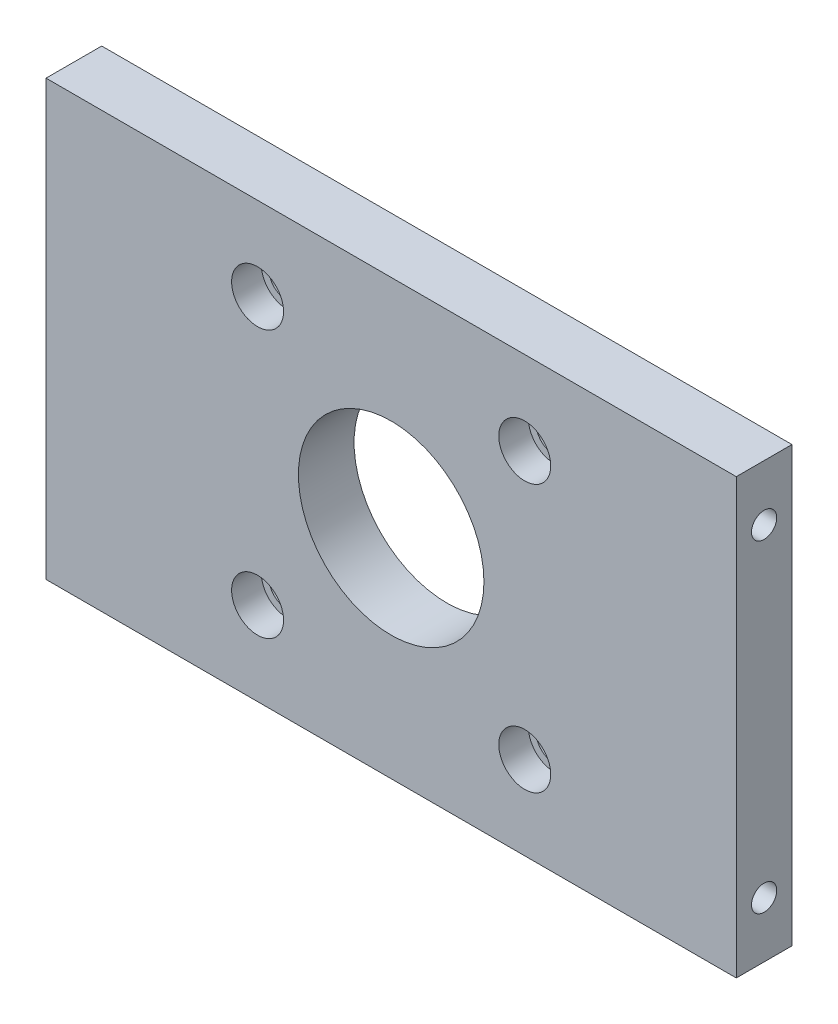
ISO-10303-21;
HEADER;
FILE_DESCRIPTION(('STEP AP214'),'2;1');
FILE_NAME('part.step','',(''),(''),'','','');
FILE_SCHEMA(('AUTOMOTIVE_DESIGN { 1 0 10303 214 1 1 1 1 }'));
ENDSEC;
DATA;
#1=APPLICATION_CONTEXT('core data for automotive mechanical design processes');
#2=APPLICATION_PROTOCOL_DEFINITION('international standard','automotive_design',2000,#1);
#3=PRODUCT_CONTEXT('',#1,'mechanical');
#4=PRODUCT('Part','Part','',(#3));
#5=PRODUCT_RELATED_PRODUCT_CATEGORY('part','',(#4));
#6=PRODUCT_DEFINITION_FORMATION('','',#4);
#7=PRODUCT_DEFINITION_CONTEXT('part definition',#1,'design');
#8=PRODUCT_DEFINITION('design','',#6,#7);
#9=PRODUCT_DEFINITION_SHAPE('','',#8);
#10=(LENGTH_UNIT() NAMED_UNIT(*) SI_UNIT(.MILLI.,.METRE.));
#11=(NAMED_UNIT(*) PLANE_ANGLE_UNIT() SI_UNIT($,.RADIAN.));
#12=(NAMED_UNIT(*) SI_UNIT($,.STERADIAN.) SOLID_ANGLE_UNIT());
#13=UNCERTAINTY_MEASURE_WITH_UNIT(LENGTH_MEASURE(1.E-05),#10,'distance_accuracy_value','');
#14=(GEOMETRIC_REPRESENTATION_CONTEXT(3) GLOBAL_UNCERTAINTY_ASSIGNED_CONTEXT((#13)) GLOBAL_UNIT_ASSIGNED_CONTEXT((#10,
#11,#12)) REPRESENTATION_CONTEXT('',''));
#15=CARTESIAN_POINT('',(0.,0.,0.));
#16=DIRECTION('',(0.,0.,1.));
#17=DIRECTION('',(1.,0.,0.));
#18=AXIS2_PLACEMENT_3D('',#15,#16,#17);
#19=CARTESIAN_POINT('',(-69.9731301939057,63.6934903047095,15.));
#20=DIRECTION('',(1.,0.,0.));
#21=DIRECTION('',(0.,1.,0.));
#22=AXIS2_PLACEMENT_3D('',#19,#20,#21);
#23=PLANE('',#22);
#24=CARTESIAN_POINT('',(-69.9731301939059,48.6934903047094,7.50000000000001));
#25=DIRECTION('',(-1.,0.,0.));
#26=DIRECTION('',(0.,0.,1.));
#27=AXIS2_PLACEMENT_3D('',#24,#25,#26);
#28=CIRCLE('',#27,3.4);
#29=CARTESIAN_POINT('',(-69.9731301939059,48.6934903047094,10.9));
#30=VERTEX_POINT('',#29);
#31=EDGE_CURVE('E113',#30,#30,#28,.T.);
#32=ORIENTED_EDGE('',*,*,#31,.F.);
#33=EDGE_LOOP('',(#32));
#34=FACE_BOUND('',#33,.T.);
#35=CARTESIAN_POINT('',(-69.9731301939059,-38.3065096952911,7.50000000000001));
#36=DIRECTION('',(-1.,0.,0.));
#37=DIRECTION('',(0.,0.,1.));
#38=AXIS2_PLACEMENT_3D('',#35,#36,#37);
#39=CIRCLE('',#38,3.4);
#40=CARTESIAN_POINT('',(-69.9731301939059,-38.3065096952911,10.9));
#41=VERTEX_POINT('',#40);
#42=EDGE_CURVE('E119',#41,#41,#39,.T.);
#43=ORIENTED_EDGE('',*,*,#42,.F.);
#44=EDGE_LOOP('',(#43));
#45=FACE_BOUND('',#44,.T.);
#46=DIRECTION('',(0.,-1.,0.));
#47=VECTOR('',#46,1.);
#48=CARTESIAN_POINT('',(-69.9731301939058,63.6934903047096,-2.22044604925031E-13));
#49=LINE('',#48,#47);
#50=CARTESIAN_POINT('',(-69.9731301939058,63.6934903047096,-2.22044604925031E-13));
#51=VERTEX_POINT('',#50);
#52=CARTESIAN_POINT('',(-69.9731301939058,-53.3065096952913,0.));
#53=VERTEX_POINT('',#52);
#54=EDGE_CURVE('E167',#51,#53,#49,.T.);
#55=ORIENTED_EDGE('',*,*,#54,.T.);
#56=DIRECTION('',(0.,0.,-1.));
#57=VECTOR('',#56,1.);
#58=CARTESIAN_POINT('',(-69.9731301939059,-53.3065096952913,15.));
#59=LINE('',#58,#57);
#60=CARTESIAN_POINT('',(-69.9731301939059,-53.3065096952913,15.));
#61=VERTEX_POINT('',#60);
#62=EDGE_CURVE('E13',#61,#53,#59,.T.);
#63=ORIENTED_EDGE('',*,*,#62,.F.);
#64=DIRECTION('',(0.,-1.,0.));
#65=VECTOR('',#64,1.);
#66=CARTESIAN_POINT('',(-69.9731301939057,63.6934903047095,15.));
#67=LINE('',#66,#65);
#68=CARTESIAN_POINT('',(-69.9731301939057,63.6934903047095,15.));
#69=VERTEX_POINT('',#68);
#70=EDGE_CURVE('E176',#69,#61,#67,.T.);
#71=ORIENTED_EDGE('',*,*,#70,.F.);
#72=DIRECTION('',(0.,0.,-1.));
#73=VECTOR('',#72,1.);
#74=CARTESIAN_POINT('',(-69.9731301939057,63.6934903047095,15.));
#75=LINE('',#74,#73);
#76=EDGE_CURVE('E182',#69,#51,#75,.T.);
#77=ORIENTED_EDGE('',*,*,#76,.T.);
#78=EDGE_LOOP('',(#55,#63,#71,#77));
#79=FACE_BOUND('',#78,.T.);
#80=ADVANCED_FACE('F38',(#34,#45,#79),#23,.F.);
#81=CARTESIAN_POINT('',(-69.9731301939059,-53.3065096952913,15.));
#82=DIRECTION('',(0.,1.,0.));
#83=DIRECTION('',(0.,0.,1.));
#84=AXIS2_PLACEMENT_3D('',#81,#82,#83);
#85=PLANE('',#84);
#86=DIRECTION('',(1.,0.,0.));
#87=VECTOR('',#86,1.);
#88=CARTESIAN_POINT('',(-69.9731301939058,-53.3065096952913,0.));
#89=LINE('',#88,#87);
#90=CARTESIAN_POINT('',(116.026869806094,-53.3065096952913,0.));
#91=VERTEX_POINT('',#90);
#92=EDGE_CURVE('E170',#53,#91,#89,.T.);
#93=ORIENTED_EDGE('',*,*,#92,.T.);
#94=DIRECTION('',(0.,0.,-1.));
#95=VECTOR('',#94,1.);
#96=CARTESIAN_POINT('',(116.026869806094,-53.3065096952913,15.));
#97=LINE('',#96,#95);
#98=CARTESIAN_POINT('',(116.026869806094,-53.3065096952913,15.));
#99=VERTEX_POINT('',#98);
#100=EDGE_CURVE('E46',#99,#91,#97,.T.);
#101=ORIENTED_EDGE('',*,*,#100,.F.);
#102=DIRECTION('',(1.,0.,0.));
#103=VECTOR('',#102,1.);
#104=CARTESIAN_POINT('',(-69.9731301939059,-53.3065096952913,15.));
#105=LINE('',#104,#103);
#106=EDGE_CURVE('E178',#61,#99,#105,.T.);
#107=ORIENTED_EDGE('',*,*,#106,.F.);
#108=ORIENTED_EDGE('',*,*,#62,.T.);
#109=EDGE_LOOP('',(#93,#101,#107,#108));
#110=FACE_BOUND('',#109,.T.);
#111=ADVANCED_FACE('F218',(#110),#85,.F.);
#112=CARTESIAN_POINT('',(116.026869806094,63.6934903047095,15.));
#113=DIRECTION('',(-1.,0.,0.));
#114=DIRECTION('',(0.,-1.,0.));
#115=AXIS2_PLACEMENT_3D('',#112,#113,#114);
#116=PLANE('',#115);
#117=CARTESIAN_POINT('',(116.026869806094,48.6934903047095,7.50000000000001));
#118=DIRECTION('',(1.,0.,0.));
#119=DIRECTION('',(0.,0.,-1.));
#120=AXIS2_PLACEMENT_3D('',#117,#118,#119);
#121=CIRCLE('',#120,3.39999999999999);
#122=CARTESIAN_POINT('',(116.026869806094,48.6934903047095,4.1));
#123=VERTEX_POINT('',#122);
#124=EDGE_CURVE('E99',#123,#123,#121,.T.);
#125=ORIENTED_EDGE('',*,*,#124,.F.);
#126=EDGE_LOOP('',(#125));
#127=FACE_BOUND('',#126,.T.);
#128=CARTESIAN_POINT('',(116.026869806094,-38.3065096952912,7.50000000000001));
#129=DIRECTION('',(1.,0.,0.));
#130=DIRECTION('',(0.,0.,-1.));
#131=AXIS2_PLACEMENT_3D('',#128,#129,#130);
#132=CIRCLE('',#131,3.39999999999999);
#133=CARTESIAN_POINT('',(116.026869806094,-38.3065096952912,4.1));
#134=VERTEX_POINT('',#133);
#135=EDGE_CURVE('E107',#134,#134,#132,.T.);
#136=ORIENTED_EDGE('',*,*,#135,.F.);
#137=EDGE_LOOP('',(#136));
#138=FACE_BOUND('',#137,.T.);
#139=DIRECTION('',(0.,1.,0.));
#140=VECTOR('',#139,1.);
#141=CARTESIAN_POINT('',(116.026869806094,63.6934903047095,0.));
#142=LINE('',#141,#140);
#143=CARTESIAN_POINT('',(116.026869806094,63.6934903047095,0.));
#144=VERTEX_POINT('',#143);
#145=EDGE_CURVE('E172',#91,#144,#142,.T.);
#146=ORIENTED_EDGE('',*,*,#145,.T.);
#147=DIRECTION('',(0.,0.,-1.));
#148=VECTOR('',#147,1.);
#149=CARTESIAN_POINT('',(116.026869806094,63.6934903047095,15.));
#150=LINE('',#149,#148);
#151=CARTESIAN_POINT('',(116.026869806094,63.6934903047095,15.));
#152=VERTEX_POINT('',#151);
#153=EDGE_CURVE('E185',#152,#144,#150,.T.);
#154=ORIENTED_EDGE('',*,*,#153,.F.);
#155=DIRECTION('',(0.,1.,0.));
#156=VECTOR('',#155,1.);
#157=CARTESIAN_POINT('',(116.026869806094,63.6934903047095,15.));
#158=LINE('',#157,#156);
#159=EDGE_CURVE('E59',#99,#152,#158,.T.);
#160=ORIENTED_EDGE('',*,*,#159,.F.);
#161=ORIENTED_EDGE('',*,*,#100,.T.);
#162=EDGE_LOOP('',(#146,#154,#160,#161));
#163=FACE_BOUND('',#162,.T.);
#164=ADVANCED_FACE('F224',(#127,#138,#163),#116,.F.);
#165=CARTESIAN_POINT('',(-69.9731301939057,63.6934903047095,15.));
#166=DIRECTION('',(0.,-1.,0.));
#167=DIRECTION('',(0.,0.,-1.));
#168=AXIS2_PLACEMENT_3D('',#165,#166,#167);
#169=PLANE('',#168);
#170=DIRECTION('',(-1.,0.,0.));
#171=VECTOR('',#170,1.);
#172=CARTESIAN_POINT('',(-69.9731301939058,63.6934903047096,-2.22044604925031E-13));
#173=LINE('',#172,#171);
#174=EDGE_CURVE('E174',#144,#51,#173,.T.);
#175=ORIENTED_EDGE('',*,*,#174,.T.);
#176=ORIENTED_EDGE('',*,*,#76,.F.);
#177=DIRECTION('',(-1.,0.,0.));
#178=VECTOR('',#177,1.);
#179=CARTESIAN_POINT('',(-69.9731301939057,63.6934903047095,15.));
#180=LINE('',#179,#178);
#181=EDGE_CURVE('E54',#152,#69,#180,.T.);
#182=ORIENTED_EDGE('',*,*,#181,.F.);
#183=ORIENTED_EDGE('',*,*,#153,.T.);
#184=EDGE_LOOP('',(#175,#176,#182,#183));
#185=FACE_BOUND('',#184,.T.);
#186=ADVANCED_FACE('F239',(#185),#169,.F.);
#187=CARTESIAN_POINT('',(-69.9731301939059,-53.3065096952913,15.));
#188=DIRECTION('',(0.,0.,1.));
#189=DIRECTION('',(1.,0.,0.));
#190=AXIS2_PLACEMENT_3D('',#187,#188,#189);
#191=PLANE('',#190);
#192=CARTESIAN_POINT('',(-12.9731301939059,41.1934903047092,15.));
#193=DIRECTION('',(0.,0.,1.));
#194=DIRECTION('',(1.,0.,0.));
#195=AXIS2_PLACEMENT_3D('',#192,#193,#194);
#196=CIRCLE('',#195,7.);
#197=CARTESIAN_POINT('',(-5.97313019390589,41.1934903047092,15.));
#198=VERTEX_POINT('',#197);
#199=EDGE_CURVE('E128',#198,#198,#196,.T.);
#200=ORIENTED_EDGE('',*,*,#199,.F.);
#201=EDGE_LOOP('',(#200));
#202=FACE_BOUND('',#201,.T.);
#203=CARTESIAN_POINT('',(-12.9731301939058,-30.8065096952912,15.));
#204=DIRECTION('',(0.,0.,1.));
#205=DIRECTION('',(1.,0.,0.));
#206=AXIS2_PLACEMENT_3D('',#203,#204,#205);
#207=CIRCLE('',#206,7.);
#208=CARTESIAN_POINT('',(-5.97313019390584,-30.8065096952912,15.));
#209=VERTEX_POINT('',#208);
#210=EDGE_CURVE('E137',#209,#209,#207,.T.);
#211=ORIENTED_EDGE('',*,*,#210,.F.);
#212=EDGE_LOOP('',(#211));
#213=FACE_BOUND('',#212,.T.);
#214=CARTESIAN_POINT('',(59.0268698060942,-30.8065096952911,15.));
#215=DIRECTION('',(0.,0.,1.));
#216=DIRECTION('',(1.,0.,0.));
#217=AXIS2_PLACEMENT_3D('',#214,#215,#216);
#218=CIRCLE('',#217,7.);
#219=CARTESIAN_POINT('',(66.0268698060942,-30.8065096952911,15.));
#220=VERTEX_POINT('',#219);
#221=EDGE_CURVE('E147',#220,#220,#218,.T.);
#222=ORIENTED_EDGE('',*,*,#221,.F.);
#223=EDGE_LOOP('',(#222));
#224=FACE_BOUND('',#223,.T.);
#225=CARTESIAN_POINT('',(59.0268698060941,41.1934903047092,15.));
#226=DIRECTION('',(0.,0.,1.));
#227=DIRECTION('',(1.,0.,0.));
#228=AXIS2_PLACEMENT_3D('',#225,#226,#227);
#229=CIRCLE('',#228,7.);
#230=CARTESIAN_POINT('',(66.0268698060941,41.1934903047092,15.));
#231=VERTEX_POINT('',#230);
#232=EDGE_CURVE('E157',#231,#231,#229,.T.);
#233=ORIENTED_EDGE('',*,*,#232,.F.);
#234=EDGE_LOOP('',(#233));
#235=FACE_BOUND('',#234,.T.);
#236=CARTESIAN_POINT('',(23.0268698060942,5.19349030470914,15.));
#237=DIRECTION('',(0.,0.,1.));
#238=DIRECTION('',(1.,0.,0.));
#239=AXIS2_PLACEMENT_3D('',#236,#237,#238);
#240=CIRCLE('',#239,25.);
#241=CARTESIAN_POINT('',(48.0268698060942,5.19349030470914,15.));
#242=VERTEX_POINT('',#241);
#243=EDGE_CURVE('E161',#242,#242,#240,.T.);
#244=ORIENTED_EDGE('',*,*,#243,.F.);
#245=EDGE_LOOP('',(#244));
#246=FACE_BOUND('',#245,.T.);
#247=ORIENTED_EDGE('',*,*,#70,.T.);
#248=ORIENTED_EDGE('',*,*,#106,.T.);
#249=ORIENTED_EDGE('',*,*,#159,.T.);
#250=ORIENTED_EDGE('',*,*,#181,.T.);
#251=EDGE_LOOP('',(#247,#248,#249,#250));
#252=FACE_BOUND('',#251,.T.);
#253=ADVANCED_FACE('F237',(#202,#213,#224,#235,#246,#252),#191,.T.);
#254=CARTESIAN_POINT('',(-69.9731301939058,-53.3065096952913,0.));
#255=DIRECTION('',(0.,0.,1.));
#256=DIRECTION('',(1.,0.,0.));
#257=AXIS2_PLACEMENT_3D('',#254,#255,#256);
#258=PLANE('',#257);
#259=CARTESIAN_POINT('',(-12.9731301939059,41.1934903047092,0.));
#260=DIRECTION('',(0.,0.,1.));
#261=DIRECTION('',(1.,0.,0.));
#262=AXIS2_PLACEMENT_3D('',#259,#260,#261);
#263=CIRCLE('',#262,4.99999999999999);
#264=CARTESIAN_POINT('',(-7.9731301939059,41.1934903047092,0.));
#265=VERTEX_POINT('',#264);
#266=EDGE_CURVE('E41',#265,#265,#263,.T.);
#267=ORIENTED_EDGE('',*,*,#266,.T.);
#268=EDGE_LOOP('',(#267));
#269=FACE_BOUND('',#268,.T.);
#270=CARTESIAN_POINT('',(-12.9731301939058,-30.8065096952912,0.));
#271=DIRECTION('',(0.,0.,1.));
#272=DIRECTION('',(1.,0.,0.));
#273=AXIS2_PLACEMENT_3D('',#270,#271,#272);
#274=CIRCLE('',#273,4.99999999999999);
#275=CARTESIAN_POINT('',(-7.97313019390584,-30.8065096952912,0.));
#276=VERTEX_POINT('',#275);
#277=EDGE_CURVE('E140',#276,#276,#274,.T.);
#278=ORIENTED_EDGE('',*,*,#277,.T.);
#279=EDGE_LOOP('',(#278));
#280=FACE_BOUND('',#279,.T.);
#281=CARTESIAN_POINT('',(59.0268698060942,-30.8065096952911,0.));
#282=DIRECTION('',(0.,0.,1.));
#283=DIRECTION('',(1.,0.,0.));
#284=AXIS2_PLACEMENT_3D('',#281,#282,#283);
#285=CIRCLE('',#284,4.99999999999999);
#286=CARTESIAN_POINT('',(64.0268698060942,-30.8065096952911,0.));
#287=VERTEX_POINT('',#286);
#288=EDGE_CURVE('E150',#287,#287,#285,.T.);
#289=ORIENTED_EDGE('',*,*,#288,.T.);
#290=EDGE_LOOP('',(#289));
#291=FACE_BOUND('',#290,.T.);
#292=CARTESIAN_POINT('',(59.0268698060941,41.1934903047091,0.));
#293=DIRECTION('',(0.,0.,1.));
#294=DIRECTION('',(1.,0.,0.));
#295=AXIS2_PLACEMENT_3D('',#292,#293,#294);
#296=CIRCLE('',#295,4.99999999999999);
#297=CARTESIAN_POINT('',(64.0268698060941,41.1934903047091,0.));
#298=VERTEX_POINT('',#297);
#299=EDGE_CURVE('E160',#298,#298,#296,.T.);
#300=ORIENTED_EDGE('',*,*,#299,.T.);
#301=EDGE_LOOP('',(#300));
#302=FACE_BOUND('',#301,.T.);
#303=CARTESIAN_POINT('',(23.0268698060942,5.19349030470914,0.));
#304=DIRECTION('',(0.,0.,1.));
#305=DIRECTION('',(1.,0.,0.));
#306=AXIS2_PLACEMENT_3D('',#303,#304,#305);
#307=CIRCLE('',#306,25.);
#308=CARTESIAN_POINT('',(48.0268698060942,5.19349030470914,0.));
#309=VERTEX_POINT('',#308);
#310=EDGE_CURVE('E164',#309,#309,#307,.T.);
#311=ORIENTED_EDGE('',*,*,#310,.T.);
#312=EDGE_LOOP('',(#311));
#313=FACE_BOUND('',#312,.T.);
#314=ORIENTED_EDGE('',*,*,#54,.F.);
#315=ORIENTED_EDGE('',*,*,#174,.F.);
#316=ORIENTED_EDGE('',*,*,#145,.F.);
#317=ORIENTED_EDGE('',*,*,#92,.F.);
#318=EDGE_LOOP('',(#314,#315,#316,#317));
#319=FACE_BOUND('',#318,.T.);
#320=ADVANCED_FACE('F196',(#269,#280,#291,#302,#313,#319),#258,.F.);
#321=CARTESIAN_POINT('',(23.0268698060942,5.19349030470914,0.));
#322=DIRECTION('',(0.,0.,1.));
#323=DIRECTION('',(1.,0.,0.));
#324=AXIS2_PLACEMENT_3D('',#321,#322,#323);
#325=CYLINDRICAL_SURFACE('',#324,25.);
#326=ORIENTED_EDGE('',*,*,#310,.F.);
#327=EDGE_LOOP('',(#326));
#328=FACE_BOUND('',#327,.T.);
#329=ORIENTED_EDGE('',*,*,#243,.T.);
#330=EDGE_LOOP('',(#329));
#331=FACE_BOUND('',#330,.T.);
#332=ADVANCED_FACE('F245',(#328,#331),#325,.F.);
#333=CARTESIAN_POINT('',(59.0268698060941,41.1934903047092,15.));
#334=DIRECTION('',(0.,0.,1.));
#335=DIRECTION('',(1.,0.,0.));
#336=AXIS2_PLACEMENT_3D('',#333,#334,#335);
#337=CYLINDRICAL_SURFACE('',#336,4.99999999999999);
#338=CARTESIAN_POINT('',(59.0268698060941,41.1934903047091,7.00000000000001));
#339=DIRECTION('',(0.,0.,1.));
#340=DIRECTION('',(1.,0.,0.));
#341=AXIS2_PLACEMENT_3D('',#338,#339,#340);
#342=CIRCLE('',#341,5.);
#343=CARTESIAN_POINT('',(64.0268698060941,41.1934903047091,7.00000000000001));
#344=VERTEX_POINT('',#343);
#345=EDGE_CURVE('E151',#344,#344,#342,.T.);
#346=ORIENTED_EDGE('',*,*,#345,.T.);
#347=EDGE_LOOP('',(#346));
#348=FACE_BOUND('',#347,.T.);
#349=ORIENTED_EDGE('',*,*,#299,.F.);
#350=EDGE_LOOP('',(#349));
#351=FACE_BOUND('',#350,.T.);
#352=ADVANCED_FACE('F353',(#348,#351),#337,.F.);
#353=CARTESIAN_POINT('',(59.0268698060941,41.1934903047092,15.));
#354=DIRECTION('',(0.,0.,1.));
#355=DIRECTION('',(1.,0.,0.));
#356=AXIS2_PLACEMENT_3D('',#353,#354,#355);
#357=CYLINDRICAL_SURFACE('',#356,7.);
#358=CARTESIAN_POINT('',(59.0268698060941,41.1934903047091,7.00000000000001));
#359=DIRECTION('',(0.,0.,1.));
#360=DIRECTION('',(1.,0.,0.));
#361=AXIS2_PLACEMENT_3D('',#358,#359,#360);
#362=CIRCLE('',#361,7.);
#363=CARTESIAN_POINT('',(66.0268698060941,41.1934903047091,7.00000000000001));
#364=VERTEX_POINT('',#363);
#365=EDGE_CURVE('E154',#364,#364,#362,.T.);
#366=ORIENTED_EDGE('',*,*,#365,.F.);
#367=EDGE_LOOP('',(#366));
#368=FACE_BOUND('',#367,.T.);
#369=ORIENTED_EDGE('',*,*,#232,.T.);
#370=EDGE_LOOP('',(#369));
#371=FACE_BOUND('',#370,.T.);
#372=ADVANCED_FACE('F356',(#368,#371),#357,.F.);
#373=CARTESIAN_POINT('',(64.0268698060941,41.1934903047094,7.00000000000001));
#374=DIRECTION('',(0.,0.,-1.));
#375=DIRECTION('',(-1.,0.,0.));
#376=AXIS2_PLACEMENT_3D('',#373,#374,#375);
#377=PLANE('',#376);
#378=ORIENTED_EDGE('',*,*,#345,.F.);
#379=EDGE_LOOP('',(#378));
#380=FACE_BOUND('',#379,.T.);
#381=ORIENTED_EDGE('',*,*,#365,.T.);
#382=EDGE_LOOP('',(#381));
#383=FACE_BOUND('',#382,.T.);
#384=ADVANCED_FACE('F347',(#380,#383),#377,.F.);
#385=CARTESIAN_POINT('',(59.0268698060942,-30.8065096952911,15.));
#386=DIRECTION('',(0.,0.,1.));
#387=DIRECTION('',(1.,0.,0.));
#388=AXIS2_PLACEMENT_3D('',#385,#386,#387);
#389=CYLINDRICAL_SURFACE('',#388,4.99999999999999);
#390=CARTESIAN_POINT('',(59.0268698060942,-30.8065096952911,7.00000000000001));
#391=DIRECTION('',(0.,0.,1.));
#392=DIRECTION('',(1.,0.,0.));
#393=AXIS2_PLACEMENT_3D('',#390,#391,#392);
#394=CIRCLE('',#393,5.);
#395=CARTESIAN_POINT('',(64.0268698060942,-30.8065096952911,7.00000000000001));
#396=VERTEX_POINT('',#395);
#397=EDGE_CURVE('E141',#396,#396,#394,.T.);
#398=ORIENTED_EDGE('',*,*,#397,.T.);
#399=EDGE_LOOP('',(#398));
#400=FACE_BOUND('',#399,.T.);
#401=ORIENTED_EDGE('',*,*,#288,.F.);
#402=EDGE_LOOP('',(#401));
#403=FACE_BOUND('',#402,.T.);
#404=ADVANCED_FACE('F345',(#400,#403),#389,.F.);
#405=CARTESIAN_POINT('',(59.0268698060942,-30.8065096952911,15.));
#406=DIRECTION('',(0.,0.,1.));
#407=DIRECTION('',(1.,0.,0.));
#408=AXIS2_PLACEMENT_3D('',#405,#406,#407);
#409=CYLINDRICAL_SURFACE('',#408,7.);
#410=CARTESIAN_POINT('',(59.0268698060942,-30.8065096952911,7.00000000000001));
#411=DIRECTION('',(0.,0.,1.));
#412=DIRECTION('',(1.,0.,0.));
#413=AXIS2_PLACEMENT_3D('',#410,#411,#412);
#414=CIRCLE('',#413,7.);
#415=CARTESIAN_POINT('',(66.0268698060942,-30.8065096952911,7.00000000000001));
#416=VERTEX_POINT('',#415);
#417=EDGE_CURVE('E144',#416,#416,#414,.T.);
#418=ORIENTED_EDGE('',*,*,#417,.F.);
#419=EDGE_LOOP('',(#418));
#420=FACE_BOUND('',#419,.T.);
#421=ORIENTED_EDGE('',*,*,#221,.T.);
#422=EDGE_LOOP('',(#421));
#423=FACE_BOUND('',#422,.T.);
#424=ADVANCED_FACE('F212',(#420,#423),#409,.F.);
#425=CARTESIAN_POINT('',(64.0268698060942,-30.8065096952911,7.00000000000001));
#426=DIRECTION('',(0.,0.,-1.));
#427=DIRECTION('',(-1.,0.,0.));
#428=AXIS2_PLACEMENT_3D('',#425,#426,#427);
#429=PLANE('',#428);
#430=ORIENTED_EDGE('',*,*,#397,.F.);
#431=EDGE_LOOP('',(#430));
#432=FACE_BOUND('',#431,.T.);
#433=ORIENTED_EDGE('',*,*,#417,.T.);
#434=EDGE_LOOP('',(#433));
#435=FACE_BOUND('',#434,.T.);
#436=ADVANCED_FACE('F202',(#432,#435),#429,.F.);
#437=CARTESIAN_POINT('',(-12.9731301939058,-30.8065096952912,15.));
#438=DIRECTION('',(0.,0.,1.));
#439=DIRECTION('',(1.,0.,0.));
#440=AXIS2_PLACEMENT_3D('',#437,#438,#439);
#441=CYLINDRICAL_SURFACE('',#440,4.99999999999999);
#442=CARTESIAN_POINT('',(-12.9731301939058,-30.8065096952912,7.00000000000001));
#443=DIRECTION('',(0.,0.,1.));
#444=DIRECTION('',(1.,0.,0.));
#445=AXIS2_PLACEMENT_3D('',#442,#443,#444);
#446=CIRCLE('',#445,4.99999999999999);
#447=CARTESIAN_POINT('',(-7.97313019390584,-30.8065096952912,7.00000000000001));
#448=VERTEX_POINT('',#447);
#449=EDGE_CURVE('E131',#448,#448,#446,.T.);
#450=ORIENTED_EDGE('',*,*,#449,.T.);
#451=EDGE_LOOP('',(#450));
#452=FACE_BOUND('',#451,.T.);
#453=ORIENTED_EDGE('',*,*,#277,.F.);
#454=EDGE_LOOP('',(#453));
#455=FACE_BOUND('',#454,.T.);
#456=ADVANCED_FACE('F199',(#452,#455),#441,.F.);
#457=CARTESIAN_POINT('',(-12.9731301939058,-30.8065096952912,15.));
#458=DIRECTION('',(0.,0.,1.));
#459=DIRECTION('',(1.,0.,0.));
#460=AXIS2_PLACEMENT_3D('',#457,#458,#459);
#461=CYLINDRICAL_SURFACE('',#460,7.);
#462=CARTESIAN_POINT('',(-12.9731301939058,-30.8065096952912,7.00000000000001));
#463=DIRECTION('',(0.,0.,1.));
#464=DIRECTION('',(1.,0.,0.));
#465=AXIS2_PLACEMENT_3D('',#462,#463,#464);
#466=CIRCLE('',#465,7.);
#467=CARTESIAN_POINT('',(-5.97313019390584,-30.8065096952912,7.00000000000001));
#468=VERTEX_POINT('',#467);
#469=EDGE_CURVE('E134',#468,#468,#466,.T.);
#470=ORIENTED_EDGE('',*,*,#469,.F.);
#471=EDGE_LOOP('',(#470));
#472=FACE_BOUND('',#471,.T.);
#473=ORIENTED_EDGE('',*,*,#210,.T.);
#474=EDGE_LOOP('',(#473));
#475=FACE_BOUND('',#474,.T.);
#476=ADVANCED_FACE('F201',(#472,#475),#461,.F.);
#477=CARTESIAN_POINT('',(-7.97313019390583,-30.806509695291,7.00000000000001));
#478=DIRECTION('',(0.,0.,-1.));
#479=DIRECTION('',(-1.,0.,0.));
#480=AXIS2_PLACEMENT_3D('',#477,#478,#479);
#481=PLANE('',#480);
#482=ORIENTED_EDGE('',*,*,#449,.F.);
#483=EDGE_LOOP('',(#482));
#484=FACE_BOUND('',#483,.T.);
#485=ORIENTED_EDGE('',*,*,#469,.T.);
#486=EDGE_LOOP('',(#485));
#487=FACE_BOUND('',#486,.T.);
#488=ADVANCED_FACE('F209',(#484,#487),#481,.F.);
#489=CARTESIAN_POINT('',(-12.9731301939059,41.1934903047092,15.));
#490=DIRECTION('',(0.,0.,1.));
#491=DIRECTION('',(1.,0.,0.));
#492=AXIS2_PLACEMENT_3D('',#489,#490,#491);
#493=CYLINDRICAL_SURFACE('',#492,4.99999999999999);
#494=CARTESIAN_POINT('',(-12.9731301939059,41.1934903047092,7.00000000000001));
#495=DIRECTION('',(0.,0.,1.));
#496=DIRECTION('',(1.,0.,0.));
#497=AXIS2_PLACEMENT_3D('',#494,#495,#496);
#498=CIRCLE('',#497,4.99999999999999);
#499=CARTESIAN_POINT('',(-7.9731301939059,41.1934903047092,7.00000000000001));
#500=VERTEX_POINT('',#499);
#501=EDGE_CURVE('E122',#500,#500,#498,.T.);
#502=ORIENTED_EDGE('',*,*,#501,.T.);
#503=EDGE_LOOP('',(#502));
#504=FACE_BOUND('',#503,.T.);
#505=ORIENTED_EDGE('',*,*,#266,.F.);
#506=EDGE_LOOP('',(#505));
#507=FACE_BOUND('',#506,.T.);
#508=ADVANCED_FACE('F295',(#504,#507),#493,.F.);
#509=CARTESIAN_POINT('',(-12.9731301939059,41.1934903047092,15.));
#510=DIRECTION('',(0.,0.,1.));
#511=DIRECTION('',(1.,0.,0.));
#512=AXIS2_PLACEMENT_3D('',#509,#510,#511);
#513=CYLINDRICAL_SURFACE('',#512,7.);
#514=CARTESIAN_POINT('',(-12.9731301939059,41.1934903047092,7.00000000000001));
#515=DIRECTION('',(0.,0.,1.));
#516=DIRECTION('',(1.,0.,0.));
#517=AXIS2_PLACEMENT_3D('',#514,#515,#516);
#518=CIRCLE('',#517,7.);
#519=CARTESIAN_POINT('',(-5.97313019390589,41.1934903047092,7.00000000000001));
#520=VERTEX_POINT('',#519);
#521=EDGE_CURVE('E125',#520,#520,#518,.T.);
#522=ORIENTED_EDGE('',*,*,#521,.F.);
#523=EDGE_LOOP('',(#522));
#524=FACE_BOUND('',#523,.T.);
#525=ORIENTED_EDGE('',*,*,#199,.T.);
#526=EDGE_LOOP('',(#525));
#527=FACE_BOUND('',#526,.T.);
#528=ADVANCED_FACE('F298',(#524,#527),#513,.F.);
#529=CARTESIAN_POINT('',(-7.97313019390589,41.1934903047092,7.00000000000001));
#530=DIRECTION('',(0.,0.,-1.));
#531=DIRECTION('',(-1.,0.,0.));
#532=AXIS2_PLACEMENT_3D('',#529,#530,#531);
#533=PLANE('',#532);
#534=ORIENTED_EDGE('',*,*,#501,.F.);
#535=EDGE_LOOP('',(#534));
#536=FACE_BOUND('',#535,.T.);
#537=ORIENTED_EDGE('',*,*,#521,.T.);
#538=EDGE_LOOP('',(#537));
#539=FACE_BOUND('',#538,.T.);
#540=ADVANCED_FACE('F293',(#536,#539),#533,.F.);
#541=CARTESIAN_POINT('',(-69.9731301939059,-38.3065096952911,7.50000000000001));
#542=DIRECTION('',(-1.,0.,0.));
#543=DIRECTION('',(0.,0.,1.));
#544=AXIS2_PLACEMENT_3D('',#541,#542,#543);
#545=CYLINDRICAL_SURFACE('',#544,3.39999999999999);
#546=CARTESIAN_POINT('',(-23.7231301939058,-38.3065096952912,7.50000000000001));
#547=DIRECTION('',(-1.,0.,0.));
#548=DIRECTION('',(0.,0.,1.));
#549=AXIS2_PLACEMENT_3D('',#546,#547,#548);
#550=CIRCLE('',#549,3.39999999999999);
#551=CARTESIAN_POINT('',(-23.7231301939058,-38.3065096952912,10.9));
#552=VERTEX_POINT('',#551);
#553=EDGE_CURVE('E116',#552,#552,#550,.T.);
#554=ORIENTED_EDGE('',*,*,#553,.F.);
#555=EDGE_LOOP('',(#554));
#556=FACE_BOUND('',#555,.T.);
#557=ORIENTED_EDGE('',*,*,#42,.T.);
#558=EDGE_LOOP('',(#557));
#559=FACE_BOUND('',#558,.T.);
#560=ADVANCED_FACE('F289',(#556,#559),#545,.F.);
#561=CARTESIAN_POINT('',(-23.7231301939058,-38.3065096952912,7.50000000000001));
#562=DIRECTION('',(-1.,0.,0.));
#563=DIRECTION('',(0.,0.,1.));
#564=AXIS2_PLACEMENT_3D('',#561,#562,#563);
#565=CONICAL_SURFACE('',#564,3.39999999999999,1.02974425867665);
#566=CARTESIAN_POINT('',(-21.6802040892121,-38.3065096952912,7.50000000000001));
#567=VERTEX_POINT('',#566);
#568=VERTEX_LOOP('',#567);
#569=FACE_BOUND('',#568,.T.);
#570=ORIENTED_EDGE('',*,*,#553,.T.);
#571=EDGE_LOOP('',(#570));
#572=FACE_BOUND('',#571,.T.);
#573=ADVANCED_FACE('F285',(#569,#572),#565,.F.);
#574=CARTESIAN_POINT('',(-69.9731301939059,48.6934903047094,7.50000000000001));
#575=DIRECTION('',(-1.,0.,0.));
#576=DIRECTION('',(0.,0.,1.));
#577=AXIS2_PLACEMENT_3D('',#574,#575,#576);
#578=CYLINDRICAL_SURFACE('',#577,3.39999999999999);
#579=CARTESIAN_POINT('',(-23.7231301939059,48.6934903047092,7.50000000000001));
#580=DIRECTION('',(-1.,0.,0.));
#581=DIRECTION('',(0.,0.,1.));
#582=AXIS2_PLACEMENT_3D('',#579,#580,#581);
#583=CIRCLE('',#582,3.39999999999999);
#584=CARTESIAN_POINT('',(-23.7231301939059,48.6934903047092,10.9));
#585=VERTEX_POINT('',#584);
#586=EDGE_CURVE('E110',#585,#585,#583,.T.);
#587=ORIENTED_EDGE('',*,*,#586,.F.);
#588=EDGE_LOOP('',(#587));
#589=FACE_BOUND('',#588,.T.);
#590=ORIENTED_EDGE('',*,*,#31,.T.);
#591=EDGE_LOOP('',(#590));
#592=FACE_BOUND('',#591,.T.);
#593=ADVANCED_FACE('F278',(#589,#592),#578,.F.);
#594=CARTESIAN_POINT('',(-23.7231301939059,48.6934903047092,7.50000000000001));
#595=DIRECTION('',(-1.,0.,0.));
#596=DIRECTION('',(0.,0.,1.));
#597=AXIS2_PLACEMENT_3D('',#594,#595,#596);
#598=CONICAL_SURFACE('',#597,3.39999999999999,1.02974425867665);
#599=CARTESIAN_POINT('',(-21.6802040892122,48.6934903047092,7.50000000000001));
#600=VERTEX_POINT('',#599);
#601=VERTEX_LOOP('',#600);
#602=FACE_BOUND('',#601,.T.);
#603=ORIENTED_EDGE('',*,*,#586,.T.);
#604=EDGE_LOOP('',(#603));
#605=FACE_BOUND('',#604,.T.);
#606=ADVANCED_FACE('F267',(#602,#605),#598,.F.);
#607=CARTESIAN_POINT('',(116.026869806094,-38.3065096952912,7.50000000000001));
#608=DIRECTION('',(1.,0.,0.));
#609=DIRECTION('',(0.,0.,-1.));
#610=AXIS2_PLACEMENT_3D('',#607,#608,#609);
#611=CYLINDRICAL_SURFACE('',#610,3.39999999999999);
#612=CARTESIAN_POINT('',(69.7768698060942,-38.3065096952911,7.50000000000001));
#613=DIRECTION('',(1.,0.,0.));
#614=DIRECTION('',(0.,0.,-1.));
#615=AXIS2_PLACEMENT_3D('',#612,#613,#614);
#616=CIRCLE('',#615,3.39999999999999);
#617=CARTESIAN_POINT('',(69.7768698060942,-38.3065096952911,4.1));
#618=VERTEX_POINT('',#617);
#619=EDGE_CURVE('E102',#618,#618,#616,.T.);
#620=ORIENTED_EDGE('',*,*,#619,.F.);
#621=EDGE_LOOP('',(#620));
#622=FACE_BOUND('',#621,.T.);
#623=ORIENTED_EDGE('',*,*,#135,.T.);
#624=EDGE_LOOP('',(#623));
#625=FACE_BOUND('',#624,.T.);
#626=ADVANCED_FACE('F264',(#622,#625),#611,.F.);
#627=CARTESIAN_POINT('',(69.7768698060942,-38.3065096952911,7.50000000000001));
#628=DIRECTION('',(1.,0.,0.));
#629=DIRECTION('',(0.,0.,-1.));
#630=AXIS2_PLACEMENT_3D('',#627,#628,#629);
#631=CONICAL_SURFACE('',#630,3.39999999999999,1.02974425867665);
#632=CARTESIAN_POINT('',(67.7339437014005,-38.3065096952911,7.50000000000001));
#633=VERTEX_POINT('',#632);
#634=VERTEX_LOOP('',#633);
#635=FACE_BOUND('',#634,.T.);
#636=ORIENTED_EDGE('',*,*,#619,.T.);
#637=EDGE_LOOP('',(#636));
#638=FACE_BOUND('',#637,.T.);
#639=ADVANCED_FACE('F266',(#635,#638),#631,.F.);
#640=CARTESIAN_POINT('',(116.026869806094,48.6934903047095,7.50000000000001));
#641=DIRECTION('',(1.,0.,0.));
#642=DIRECTION('',(0.,0.,-1.));
#643=AXIS2_PLACEMENT_3D('',#640,#641,#642);
#644=CYLINDRICAL_SURFACE('',#643,3.39999999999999);
#645=CARTESIAN_POINT('',(69.7768698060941,48.6934903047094,7.50000000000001));
#646=DIRECTION('',(1.,0.,0.));
#647=DIRECTION('',(0.,0.,-1.));
#648=AXIS2_PLACEMENT_3D('',#645,#646,#647);
#649=CIRCLE('',#648,3.39999999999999);
#650=CARTESIAN_POINT('',(69.7768698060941,48.6934903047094,4.1));
#651=VERTEX_POINT('',#650);
#652=EDGE_CURVE('E97',#651,#651,#649,.T.);
#653=ORIENTED_EDGE('',*,*,#652,.F.);
#654=EDGE_LOOP('',(#653));
#655=FACE_BOUND('',#654,.T.);
#656=ORIENTED_EDGE('',*,*,#124,.T.);
#657=EDGE_LOOP('',(#656));
#658=FACE_BOUND('',#657,.T.);
#659=ADVANCED_FACE('F93',(#655,#658),#644,.F.);
#660=CARTESIAN_POINT('',(69.7768698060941,48.6934903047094,7.50000000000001));
#661=DIRECTION('',(1.,0.,0.));
#662=DIRECTION('',(0.,0.,-1.));
#663=AXIS2_PLACEMENT_3D('',#660,#661,#662);
#664=CONICAL_SURFACE('',#663,3.39999999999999,1.02974425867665);
#665=CARTESIAN_POINT('',(67.7339437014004,48.6934903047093,7.50000000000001));
#666=VERTEX_POINT('',#665);
#667=VERTEX_LOOP('',#666);
#668=FACE_BOUND('',#667,.T.);
#669=ORIENTED_EDGE('',*,*,#652,.T.);
#670=EDGE_LOOP('',(#669));
#671=FACE_BOUND('',#670,.T.);
#672=ADVANCED_FACE('F90',(#668,#671),#664,.F.);
#673=CLOSED_SHELL('',(#80,#111,#164,#186,#253,#320,#332,#352,#372,#384,#404,#424,#436,#456,#476,
#488,#508,#528,#540,#560,#573,#593,#606,#626,#639,#659,#672));
#674=MANIFOLD_SOLID_BREP('B2',#673);
#675=ADVANCED_BREP_SHAPE_REPRESENTATION('',(#18,#674),#14);
#676=SHAPE_DEFINITION_REPRESENTATION(#9,#675);
ENDSEC;
END-ISO-10303-21;
